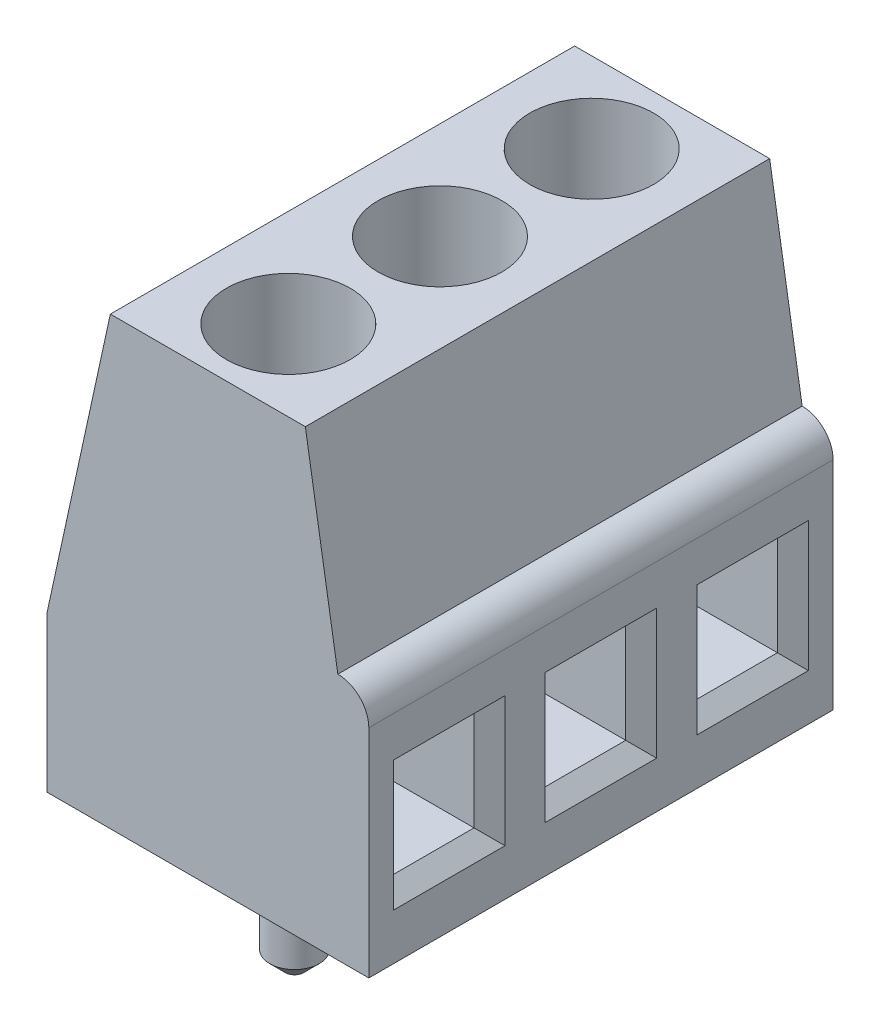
ISO-10303-21;
HEADER;
FILE_DESCRIPTION(('STEP AP214'),'2;1');
FILE_NAME('part.step','',(''),(''),'','','');
FILE_SCHEMA(('AUTOMOTIVE_DESIGN { 1 0 10303 214 1 1 1 1 }'));
ENDSEC;
DATA;
#1=APPLICATION_CONTEXT('core data for automotive mechanical design processes');
#2=APPLICATION_PROTOCOL_DEFINITION('international standard','automotive_design',2000,#1);
#3=PRODUCT_CONTEXT('',#1,'mechanical');
#4=PRODUCT('Part','Part','',(#3));
#5=PRODUCT_RELATED_PRODUCT_CATEGORY('part','',(#4));
#6=PRODUCT_DEFINITION_FORMATION('','',#4);
#7=PRODUCT_DEFINITION_CONTEXT('part definition',#1,'design');
#8=PRODUCT_DEFINITION('design','',#6,#7);
#9=PRODUCT_DEFINITION_SHAPE('','',#8);
#10=(LENGTH_UNIT() NAMED_UNIT(*) SI_UNIT(.MILLI.,.METRE.));
#11=(NAMED_UNIT(*) PLANE_ANGLE_UNIT() SI_UNIT($,.RADIAN.));
#12=(NAMED_UNIT(*) SI_UNIT($,.STERADIAN.) SOLID_ANGLE_UNIT());
#13=UNCERTAINTY_MEASURE_WITH_UNIT(LENGTH_MEASURE(1.E-05),#10,'distance_accuracy_value','');
#14=(GEOMETRIC_REPRESENTATION_CONTEXT(3) GLOBAL_UNCERTAINTY_ASSIGNED_CONTEXT((#13)) GLOBAL_UNIT_ASSIGNED_CONTEXT((#10,
#11,#12)) REPRESENTATION_CONTEXT('',''));
#15=CARTESIAN_POINT('',(0.,0.,0.));
#16=DIRECTION('',(0.,0.,1.));
#17=DIRECTION('',(1.,0.,0.));
#18=AXIS2_PLACEMENT_3D('',#15,#16,#17);
#19=CARTESIAN_POINT('',(-10.4,-8.68947368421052,15.));
#20=DIRECTION('',(1.,0.,0.));
#21=DIRECTION('',(0.,0.,-1.));
#22=AXIS2_PLACEMENT_3D('',#19,#20,#21);
#23=PLANE('',#22);
#24=DIRECTION('',(0.,-1.,0.));
#25=VECTOR('',#24,1.);
#26=CARTESIAN_POINT('',(-10.4,-8.68947368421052,0.));
#27=LINE('',#26,#25);
#28=CARTESIAN_POINT('',(-10.4,-3.68947368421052,0.));
#29=VERTEX_POINT('',#28);
#30=CARTESIAN_POINT('',(-10.4,-8.68947368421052,0.));
#31=VERTEX_POINT('',#30);
#32=EDGE_CURVE('E285',#29,#31,#27,.T.);
#33=ORIENTED_EDGE('',*,*,#32,.T.);
#34=DIRECTION('',(0.,0.,-1.));
#35=VECTOR('',#34,1.);
#36=CARTESIAN_POINT('',(-10.4,-8.68947368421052,15.));
#37=LINE('',#36,#35);
#38=CARTESIAN_POINT('',(-10.4,-8.68947368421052,15.));
#39=VERTEX_POINT('',#38);
#40=EDGE_CURVE('E339',#39,#31,#37,.T.);
#41=ORIENTED_EDGE('',*,*,#40,.F.);
#42=DIRECTION('',(0.,-1.,0.));
#43=VECTOR('',#42,1.);
#44=CARTESIAN_POINT('',(-10.4,-8.68947368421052,15.));
#45=LINE('',#44,#43);
#46=CARTESIAN_POINT('',(-10.4,-3.68947368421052,15.));
#47=VERTEX_POINT('',#46);
#48=EDGE_CURVE('E292',#47,#39,#45,.T.);
#49=ORIENTED_EDGE('',*,*,#48,.F.);
#50=DIRECTION('',(0.,0.,-1.));
#51=VECTOR('',#50,1.);
#52=CARTESIAN_POINT('',(-10.4,-3.68947368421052,15.));
#53=LINE('',#52,#51);
#54=EDGE_CURVE('E308',#47,#29,#53,.T.);
#55=ORIENTED_EDGE('',*,*,#54,.T.);
#56=EDGE_LOOP('',(#33,#41,#49,#55));
#57=FACE_BOUND('',#56,.T.);
#58=ADVANCED_FACE('F35',(#57),#23,.F.);
#59=CARTESIAN_POINT('',(-10.4,-8.68947368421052,15.));
#60=DIRECTION('',(0.,1.,0.));
#61=DIRECTION('',(0.,0.,1.));
#62=AXIS2_PLACEMENT_3D('',#59,#60,#61);
#63=PLANE('',#62);
#64=CARTESIAN_POINT('',(-5.,-8.68947368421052,2.6));
#65=DIRECTION('',(0.,1.,0.));
#66=DIRECTION('',(0.,0.,1.));
#67=AXIS2_PLACEMENT_3D('',#64,#65,#66);
#68=CIRCLE('',#67,0.800000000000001);
#69=CARTESIAN_POINT('',(-5.,-8.68947368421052,3.4));
#70=VERTEX_POINT('',#69);
#71=EDGE_CURVE('E425',#70,#70,#68,.F.);
#72=ORIENTED_EDGE('',*,*,#71,.F.);
#73=EDGE_LOOP('',(#72));
#74=FACE_BOUND('',#73,.T.);
#75=CARTESIAN_POINT('',(-5.,-8.68947368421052,7.5));
#76=DIRECTION('',(0.,1.,0.));
#77=DIRECTION('',(0.,0.,1.));
#78=AXIS2_PLACEMENT_3D('',#75,#76,#77);
#79=CIRCLE('',#78,0.800000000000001);
#80=CARTESIAN_POINT('',(-5.,-8.68947368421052,8.3));
#81=VERTEX_POINT('',#80);
#82=EDGE_CURVE('E422',#81,#81,#79,.F.);
#83=ORIENTED_EDGE('',*,*,#82,.F.);
#84=EDGE_LOOP('',(#83));
#85=FACE_BOUND('',#84,.T.);
#86=CARTESIAN_POINT('',(-5.,-8.68947368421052,12.4));
#87=DIRECTION('',(0.,1.,0.));
#88=DIRECTION('',(0.,0.,1.));
#89=AXIS2_PLACEMENT_3D('',#86,#87,#88);
#90=CIRCLE('',#89,0.800000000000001);
#91=CARTESIAN_POINT('',(-5.,-8.68947368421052,13.2));
#92=VERTEX_POINT('',#91);
#93=EDGE_CURVE('E392',#92,#92,#90,.F.);
#94=ORIENTED_EDGE('',*,*,#93,.F.);
#95=EDGE_LOOP('',(#94));
#96=FACE_BOUND('',#95,.T.);
#97=DIRECTION('',(1.,0.,0.));
#98=VECTOR('',#97,1.);
#99=CARTESIAN_POINT('',(-10.4,-8.68947368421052,0.));
#100=LINE('',#99,#98);
#101=CARTESIAN_POINT('',(0.,-8.68947368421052,0.));
#102=VERTEX_POINT('',#101);
#103=EDGE_CURVE('E311',#31,#102,#100,.T.);
#104=ORIENTED_EDGE('',*,*,#103,.T.);
#105=DIRECTION('',(0.,0.,-1.));
#106=VECTOR('',#105,1.);
#107=CARTESIAN_POINT('',(0.,-8.68947368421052,15.));
#108=LINE('',#107,#106);
#109=CARTESIAN_POINT('',(0.,-8.68947368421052,15.));
#110=VERTEX_POINT('',#109);
#111=EDGE_CURVE('E336',#110,#102,#108,.T.);
#112=ORIENTED_EDGE('',*,*,#111,.F.);
#113=DIRECTION('',(1.,0.,0.));
#114=VECTOR('',#113,1.);
#115=CARTESIAN_POINT('',(-10.4,-8.68947368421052,15.));
#116=LINE('',#115,#114);
#117=EDGE_CURVE('E295',#39,#110,#116,.T.);
#118=ORIENTED_EDGE('',*,*,#117,.F.);
#119=ORIENTED_EDGE('',*,*,#40,.T.);
#120=EDGE_LOOP('',(#104,#112,#118,#119));
#121=FACE_BOUND('',#120,.T.);
#122=ADVANCED_FACE('F459',(#74,#85,#96,#121),#63,.F.);
#123=CARTESIAN_POINT('',(0.,-8.68947368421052,15.));
#124=DIRECTION('',(-1.,0.,0.));
#125=DIRECTION('',(0.,0.,1.));
#126=AXIS2_PLACEMENT_3D('',#123,#124,#125);
#127=PLANE('',#126);
#128=DIRECTION('',(0.,-1.,0.));
#129=VECTOR('',#128,1.);
#130=CARTESIAN_POINT('',(0.,-8.68947368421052,0.799999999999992));
#131=LINE('',#130,#129);
#132=CARTESIAN_POINT('',(0.,-2.98947368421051,0.799999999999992));
#133=VERTEX_POINT('',#132);
#134=CARTESIAN_POINT('',(0.,-7.18947368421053,0.799999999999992));
#135=VERTEX_POINT('',#134);
#136=EDGE_CURVE('E366',#133,#135,#131,.T.);
#137=ORIENTED_EDGE('',*,*,#136,.T.);
#138=DIRECTION('',(0.,0.,1.));
#139=VECTOR('',#138,1.);
#140=CARTESIAN_POINT('',(0.,-7.18947368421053,15.));
#141=LINE('',#140,#139);
#142=CARTESIAN_POINT('',(0.,-7.18947368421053,4.40000000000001));
#143=VERTEX_POINT('',#142);
#144=EDGE_CURVE('E368',#135,#143,#141,.T.);
#145=ORIENTED_EDGE('',*,*,#144,.T.);
#146=DIRECTION('',(0.,1.,0.));
#147=VECTOR('',#146,1.);
#148=CARTESIAN_POINT('',(0.,-8.68947368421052,4.40000000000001));
#149=LINE('',#148,#147);
#150=CARTESIAN_POINT('',(0.,-2.98947368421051,4.40000000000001));
#151=VERTEX_POINT('',#150);
#152=EDGE_CURVE('E362',#143,#151,#149,.T.);
#153=ORIENTED_EDGE('',*,*,#152,.T.);
#154=DIRECTION('',(0.,0.,-1.));
#155=VECTOR('',#154,1.);
#156=CARTESIAN_POINT('',(0.,-2.98947368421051,15.));
#157=LINE('',#156,#155);
#158=EDGE_CURVE('E364',#151,#133,#157,.T.);
#159=ORIENTED_EDGE('',*,*,#158,.T.);
#160=EDGE_LOOP('',(#137,#145,#153,#159));
#161=FACE_BOUND('',#160,.T.);
#162=DIRECTION('',(0.,-1.,0.));
#163=VECTOR('',#162,1.);
#164=CARTESIAN_POINT('',(0.,-8.68947368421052,5.69999999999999));
#165=LINE('',#164,#163);
#166=CARTESIAN_POINT('',(0.,-2.98947368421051,5.69999999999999));
#167=VERTEX_POINT('',#166);
#168=CARTESIAN_POINT('',(0.,-7.18947368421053,5.69999999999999));
#169=VERTEX_POINT('',#168);
#170=EDGE_CURVE('E357',#167,#169,#165,.T.);
#171=ORIENTED_EDGE('',*,*,#170,.T.);
#172=DIRECTION('',(0.,0.,1.));
#173=VECTOR('',#172,1.);
#174=CARTESIAN_POINT('',(0.,-7.18947368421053,15.));
#175=LINE('',#174,#173);
#176=CARTESIAN_POINT('',(0.,-7.18947368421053,9.30000000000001));
#177=VERTEX_POINT('',#176);
#178=EDGE_CURVE('E359',#169,#177,#175,.T.);
#179=ORIENTED_EDGE('',*,*,#178,.T.);
#180=DIRECTION('',(0.,1.,0.));
#181=VECTOR('',#180,1.);
#182=CARTESIAN_POINT('',(0.,-8.68947368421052,9.30000000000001));
#183=LINE('',#182,#181);
#184=CARTESIAN_POINT('',(0.,-2.98947368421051,9.30000000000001));
#185=VERTEX_POINT('',#184);
#186=EDGE_CURVE('E353',#177,#185,#183,.T.);
#187=ORIENTED_EDGE('',*,*,#186,.T.);
#188=DIRECTION('',(0.,0.,-1.));
#189=VECTOR('',#188,1.);
#190=CARTESIAN_POINT('',(0.,-2.98947368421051,15.));
#191=LINE('',#190,#189);
#192=EDGE_CURVE('E355',#185,#167,#191,.T.);
#193=ORIENTED_EDGE('',*,*,#192,.T.);
#194=EDGE_LOOP('',(#171,#179,#187,#193));
#195=FACE_BOUND('',#194,.T.);
#196=DIRECTION('',(0.,-1.,0.));
#197=VECTOR('',#196,1.);
#198=CARTESIAN_POINT('',(0.,-8.68947368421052,10.6));
#199=LINE('',#198,#197);
#200=CARTESIAN_POINT('',(0.,-2.98947368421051,10.6));
#201=VERTEX_POINT('',#200);
#202=CARTESIAN_POINT('',(0.,-7.18947368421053,10.6));
#203=VERTEX_POINT('',#202);
#204=EDGE_CURVE('E346',#201,#203,#199,.T.);
#205=ORIENTED_EDGE('',*,*,#204,.T.);
#206=DIRECTION('',(0.,0.,1.));
#207=VECTOR('',#206,1.);
#208=CARTESIAN_POINT('',(0.,-7.18947368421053,15.));
#209=LINE('',#208,#207);
#210=CARTESIAN_POINT('',(0.,-7.18947368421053,14.2));
#211=VERTEX_POINT('',#210);
#212=EDGE_CURVE('E350',#203,#211,#209,.T.);
#213=ORIENTED_EDGE('',*,*,#212,.T.);
#214=DIRECTION('',(0.,1.,0.));
#215=VECTOR('',#214,1.);
#216=CARTESIAN_POINT('',(0.,-8.68947368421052,14.2));
#217=LINE('',#216,#215);
#218=CARTESIAN_POINT('',(0.,-2.98947368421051,14.2));
#219=VERTEX_POINT('',#218);
#220=EDGE_CURVE('E348',#211,#219,#217,.T.);
#221=ORIENTED_EDGE('',*,*,#220,.T.);
#222=DIRECTION('',(0.,0.,-1.));
#223=VECTOR('',#222,1.);
#224=CARTESIAN_POINT('',(0.,-2.98947368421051,15.));
#225=LINE('',#224,#223);
#226=EDGE_CURVE('E344',#219,#201,#225,.T.);
#227=ORIENTED_EDGE('',*,*,#226,.T.);
#228=EDGE_LOOP('',(#205,#213,#221,#227));
#229=FACE_BOUND('',#228,.T.);
#230=DIRECTION('',(0.,1.,0.));
#231=VECTOR('',#230,1.);
#232=CARTESIAN_POINT('',(0.,-8.68947368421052,0.));
#233=LINE('',#232,#231);
#234=CARTESIAN_POINT('',(0.,-1.68947368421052,0.));
#235=VERTEX_POINT('',#234);
#236=EDGE_CURVE('E313',#102,#235,#233,.T.);
#237=ORIENTED_EDGE('',*,*,#236,.T.);
#238=DIRECTION('',(0.,0.,-1.));
#239=VECTOR('',#238,1.);
#240=CARTESIAN_POINT('',(0.,-1.68947368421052,15.));
#241=LINE('',#240,#239);
#242=CARTESIAN_POINT('',(0.,-1.68947368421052,15.));
#243=VERTEX_POINT('',#242);
#244=EDGE_CURVE('E333',#243,#235,#241,.T.);
#245=ORIENTED_EDGE('',*,*,#244,.F.);
#246=DIRECTION('',(0.,1.,0.));
#247=VECTOR('',#246,1.);
#248=CARTESIAN_POINT('',(0.,-8.68947368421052,15.));
#249=LINE('',#248,#247);
#250=EDGE_CURVE('E298',#110,#243,#249,.T.);
#251=ORIENTED_EDGE('',*,*,#250,.F.);
#252=ORIENTED_EDGE('',*,*,#111,.T.);
#253=EDGE_LOOP('',(#237,#245,#251,#252));
#254=FACE_BOUND('',#253,.T.);
#255=ADVANCED_FACE('F465',(#161,#195,#229,#254),#127,.F.);
#256=CARTESIAN_POINT('',(-1.,-1.68947368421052,15.));
#257=DIRECTION('',(0.,0.,-1.));
#258=DIRECTION('',(-1.,0.,0.));
#259=AXIS2_PLACEMENT_3D('',#256,#257,#258);
#260=CYLINDRICAL_SURFACE('',#259,1.);
#261=CARTESIAN_POINT('',(-1.,-1.68947368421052,0.));
#262=DIRECTION('',(0.,0.,1.));
#263=DIRECTION('',(-1.,0.,0.));
#264=AXIS2_PLACEMENT_3D('',#261,#262,#263);
#265=CIRCLE('',#264,1.);
#266=CARTESIAN_POINT('',(-1.,-0.689473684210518,0.));
#267=VERTEX_POINT('',#266);
#268=EDGE_CURVE('E315',#235,#267,#265,.T.);
#269=ORIENTED_EDGE('',*,*,#268,.T.);
#270=DIRECTION('',(0.,0.,-1.));
#271=VECTOR('',#270,1.);
#272=CARTESIAN_POINT('',(-1.,-0.689473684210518,15.));
#273=LINE('',#272,#271);
#274=CARTESIAN_POINT('',(-1.,-0.689473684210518,15.));
#275=VERTEX_POINT('',#274);
#276=EDGE_CURVE('E330',#275,#267,#273,.T.);
#277=ORIENTED_EDGE('',*,*,#276,.F.);
#278=CARTESIAN_POINT('',(-1.,-1.68947368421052,15.));
#279=DIRECTION('',(0.,0.,1.));
#280=DIRECTION('',(-1.,0.,0.));
#281=AXIS2_PLACEMENT_3D('',#278,#279,#280);
#282=CIRCLE('',#281,1.);
#283=EDGE_CURVE('E300',#243,#275,#282,.T.);
#284=ORIENTED_EDGE('',*,*,#283,.F.);
#285=ORIENTED_EDGE('',*,*,#244,.T.);
#286=EDGE_LOOP('',(#269,#277,#284,#285));
#287=FACE_BOUND('',#286,.T.);
#288=ADVANCED_FACE('F556',(#287),#260,.T.);
#289=CARTESIAN_POINT('',(-2.05,5.71052631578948,15.));
#290=DIRECTION('',(-0.986807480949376,-0.161898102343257,0.));
#291=DIRECTION('',(0.161898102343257,-0.986807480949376,0.));
#292=AXIS2_PLACEMENT_3D('',#289,#290,#291);
#293=PLANE('',#292);
#294=DIRECTION('',(-0.161898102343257,0.986807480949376,0.));
#295=VECTOR('',#294,1.);
#296=CARTESIAN_POINT('',(-2.05,5.71052631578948,0.));
#297=LINE('',#296,#295);
#298=CARTESIAN_POINT('',(-2.05,5.71052631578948,0.));
#299=VERTEX_POINT('',#298);
#300=EDGE_CURVE('E317',#267,#299,#297,.T.);
#301=ORIENTED_EDGE('',*,*,#300,.T.);
#302=DIRECTION('',(0.,0.,-1.));
#303=VECTOR('',#302,1.);
#304=CARTESIAN_POINT('',(-2.05,5.71052631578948,15.));
#305=LINE('',#304,#303);
#306=CARTESIAN_POINT('',(-2.05,5.71052631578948,15.));
#307=VERTEX_POINT('',#306);
#308=EDGE_CURVE('E327',#307,#299,#305,.T.);
#309=ORIENTED_EDGE('',*,*,#308,.F.);
#310=DIRECTION('',(-0.161898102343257,0.986807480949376,0.));
#311=VECTOR('',#310,1.);
#312=CARTESIAN_POINT('',(-2.05,5.71052631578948,15.));
#313=LINE('',#312,#311);
#314=EDGE_CURVE('E302',#275,#307,#313,.T.);
#315=ORIENTED_EDGE('',*,*,#314,.F.);
#316=ORIENTED_EDGE('',*,*,#276,.T.);
#317=EDGE_LOOP('',(#301,#309,#315,#316));
#318=FACE_BOUND('',#317,.T.);
#319=ADVANCED_FACE('F560',(#318),#293,.F.);
#320=CARTESIAN_POINT('',(-8.35,5.71052631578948,15.));
#321=DIRECTION('',(0.,-1.,0.));
#322=DIRECTION('',(0.,0.,-1.));
#323=AXIS2_PLACEMENT_3D('',#320,#321,#322);
#324=PLANE('',#323);
#325=CARTESIAN_POINT('',(-5.2,5.71052631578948,2.6));
#326=DIRECTION('',(0.,1.,0.));
#327=DIRECTION('',(0.,0.,1.));
#328=AXIS2_PLACEMENT_3D('',#325,#326,#327);
#329=CIRCLE('',#328,2.);
#330=CARTESIAN_POINT('',(-5.2,5.71052631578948,4.6));
#331=VERTEX_POINT('',#330);
#332=EDGE_CURVE('E1114',#331,#331,#329,.T.);
#333=ORIENTED_EDGE('',*,*,#332,.F.);
#334=EDGE_LOOP('',(#333));
#335=FACE_BOUND('',#334,.T.);
#336=CARTESIAN_POINT('',(-5.2,5.71052631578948,7.5));
#337=DIRECTION('',(0.,1.,0.));
#338=DIRECTION('',(0.,0.,1.));
#339=AXIS2_PLACEMENT_3D('',#336,#337,#338);
#340=CIRCLE('',#339,2.);
#341=CARTESIAN_POINT('',(-5.2,5.71052631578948,9.5));
#342=VERTEX_POINT('',#341);
#343=EDGE_CURVE('E1113',#342,#342,#340,.T.);
#344=ORIENTED_EDGE('',*,*,#343,.F.);
#345=EDGE_LOOP('',(#344));
#346=FACE_BOUND('',#345,.T.);
#347=CARTESIAN_POINT('',(-5.2,5.71052631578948,12.4));
#348=DIRECTION('',(0.,1.,0.));
#349=DIRECTION('',(0.,0.,1.));
#350=AXIS2_PLACEMENT_3D('',#347,#348,#349);
#351=CIRCLE('',#350,2.);
#352=CARTESIAN_POINT('',(-5.2,5.71052631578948,14.4));
#353=VERTEX_POINT('',#352);
#354=EDGE_CURVE('E235',#353,#353,#351,.T.);
#355=ORIENTED_EDGE('',*,*,#354,.F.);
#356=EDGE_LOOP('',(#355));
#357=FACE_BOUND('',#356,.T.);
#358=DIRECTION('',(-1.,0.,0.));
#359=VECTOR('',#358,1.);
#360=CARTESIAN_POINT('',(-8.35,5.71052631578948,0.));
#361=LINE('',#360,#359);
#362=CARTESIAN_POINT('',(-8.35,5.71052631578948,0.));
#363=VERTEX_POINT('',#362);
#364=EDGE_CURVE('E319',#299,#363,#361,.T.);
#365=ORIENTED_EDGE('',*,*,#364,.T.);
#366=DIRECTION('',(0.,0.,-1.));
#367=VECTOR('',#366,1.);
#368=CARTESIAN_POINT('',(-8.35,5.71052631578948,15.));
#369=LINE('',#368,#367);
#370=CARTESIAN_POINT('',(-8.35,5.71052631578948,15.));
#371=VERTEX_POINT('',#370);
#372=EDGE_CURVE('E324',#371,#363,#369,.T.);
#373=ORIENTED_EDGE('',*,*,#372,.F.);
#374=DIRECTION('',(-1.,0.,0.));
#375=VECTOR('',#374,1.);
#376=CARTESIAN_POINT('',(-8.35,5.71052631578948,15.));
#377=LINE('',#376,#375);
#378=EDGE_CURVE('E304',#307,#371,#377,.T.);
#379=ORIENTED_EDGE('',*,*,#378,.F.);
#380=ORIENTED_EDGE('',*,*,#308,.T.);
#381=EDGE_LOOP('',(#365,#373,#379,#380));
#382=FACE_BOUND('',#381,.T.);
#383=ADVANCED_FACE('F573',(#335,#346,#357,#382),#324,.F.);
#384=CARTESIAN_POINT('',(-10.4,-3.68947368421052,15.));
#385=DIRECTION('',(0.977035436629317,-0.213076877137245,0.));
#386=DIRECTION('',(0.213076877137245,0.977035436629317,0.));
#387=AXIS2_PLACEMENT_3D('',#384,#385,#386);
#388=PLANE('',#387);
#389=DIRECTION('',(-0.213076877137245,-0.977035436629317,0.));
#390=VECTOR('',#389,1.);
#391=CARTESIAN_POINT('',(-10.4,-3.68947368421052,0.));
#392=LINE('',#391,#390);
#393=EDGE_CURVE('E296',#363,#29,#392,.T.);
#394=ORIENTED_EDGE('',*,*,#393,.T.);
#395=ORIENTED_EDGE('',*,*,#54,.F.);
#396=DIRECTION('',(-0.213076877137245,-0.977035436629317,0.));
#397=VECTOR('',#396,1.);
#398=CARTESIAN_POINT('',(-10.4,-3.68947368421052,15.));
#399=LINE('',#398,#397);
#400=EDGE_CURVE('E306',#371,#47,#399,.T.);
#401=ORIENTED_EDGE('',*,*,#400,.F.);
#402=ORIENTED_EDGE('',*,*,#372,.T.);
#403=EDGE_LOOP('',(#394,#395,#401,#402));
#404=FACE_BOUND('',#403,.T.);
#405=ADVANCED_FACE('F571',(#404),#388,.F.);
#406=CARTESIAN_POINT('',(-1.,-1.68947368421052,15.));
#407=DIRECTION('',(0.,0.,-1.));
#408=DIRECTION('',(-1.,0.,0.));
#409=AXIS2_PLACEMENT_3D('',#406,#407,#408);
#410=PLANE('',#409);
#411=ORIENTED_EDGE('',*,*,#48,.T.);
#412=ORIENTED_EDGE('',*,*,#117,.T.);
#413=ORIENTED_EDGE('',*,*,#250,.T.);
#414=ORIENTED_EDGE('',*,*,#283,.T.);
#415=ORIENTED_EDGE('',*,*,#314,.T.);
#416=ORIENTED_EDGE('',*,*,#378,.T.);
#417=ORIENTED_EDGE('',*,*,#400,.T.);
#418=EDGE_LOOP('',(#411,#412,#413,#414,#415,#416,#417));
#419=FACE_BOUND('',#418,.T.);
#420=ADVANCED_FACE('F564',(#419),#410,.F.);
#421=CARTESIAN_POINT('',(-1.,-1.68947368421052,0.));
#422=DIRECTION('',(0.,0.,-1.));
#423=DIRECTION('',(-1.,0.,0.));
#424=AXIS2_PLACEMENT_3D('',#421,#422,#423);
#425=PLANE('',#424);
#426=ORIENTED_EDGE('',*,*,#32,.F.);
#427=ORIENTED_EDGE('',*,*,#393,.F.);
#428=ORIENTED_EDGE('',*,*,#364,.F.);
#429=ORIENTED_EDGE('',*,*,#300,.F.);
#430=ORIENTED_EDGE('',*,*,#268,.F.);
#431=ORIENTED_EDGE('',*,*,#236,.F.);
#432=ORIENTED_EDGE('',*,*,#103,.F.);
#433=EDGE_LOOP('',(#426,#427,#428,#429,#430,#431,#432));
#434=FACE_BOUND('',#433,.T.);
#435=ADVANCED_FACE('F551',(#434),#425,.T.);
#436=CARTESIAN_POINT('',(-5.,-3.48947368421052,13.7));
#437=DIRECTION('',(0.,0.,1.));
#438=DIRECTION('',(1.,0.,0.));
#439=AXIS2_PLACEMENT_3D('',#436,#437,#438);
#440=PLANE('',#439);
#441=DIRECTION('',(1.,0.,0.));
#442=VECTOR('',#441,1.);
#443=CARTESIAN_POINT('',(-5.,-3.48947368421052,13.7));
#444=LINE('',#443,#442);
#445=CARTESIAN_POINT('',(-5.,-3.48947368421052,13.7));
#446=VERTEX_POINT('',#445);
#447=CARTESIAN_POINT('',(-0.500000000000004,-3.48947368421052,13.7));
#448=VERTEX_POINT('',#447);
#449=EDGE_CURVE('E283',#446,#448,#444,.T.);
#450=ORIENTED_EDGE('',*,*,#449,.T.);
#451=DIRECTION('',(0.,-1.,0.));
#452=VECTOR('',#451,1.);
#453=CARTESIAN_POINT('',(-0.500000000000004,-3.48947368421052,13.7));
#454=LINE('',#453,#452);
#455=CARTESIAN_POINT('',(-0.500000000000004,-6.68947368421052,13.7));
#456=VERTEX_POINT('',#455);
#457=EDGE_CURVE('E388',#448,#456,#454,.T.);
#458=ORIENTED_EDGE('',*,*,#457,.T.);
#459=DIRECTION('',(1.,0.,0.));
#460=VECTOR('',#459,1.);
#461=CARTESIAN_POINT('',(-5.,-6.68947368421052,13.7));
#462=LINE('',#461,#460);
#463=CARTESIAN_POINT('',(-5.,-6.68947368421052,13.7));
#464=VERTEX_POINT('',#463);
#465=EDGE_CURVE('E282',#464,#456,#462,.T.);
#466=ORIENTED_EDGE('',*,*,#465,.F.);
#467=DIRECTION('',(0.,-1.,0.));
#468=VECTOR('',#467,1.);
#469=CARTESIAN_POINT('',(-5.,-3.48947368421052,13.7));
#470=LINE('',#469,#468);
#471=EDGE_CURVE('E262',#446,#464,#470,.T.);
#472=ORIENTED_EDGE('',*,*,#471,.F.);
#473=EDGE_LOOP('',(#450,#458,#466,#472));
#474=FACE_BOUND('',#473,.T.);
#475=ADVANCED_FACE('F616',(#474),#440,.F.);
#476=CARTESIAN_POINT('',(-5.,-3.48947368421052,13.7));
#477=DIRECTION('',(0.,1.,0.));
#478=DIRECTION('',(0.,0.,1.));
#479=AXIS2_PLACEMENT_3D('',#476,#477,#478);
#480=PLANE('',#479);
#481=DIRECTION('',(1.,0.,0.));
#482=VECTOR('',#481,1.);
#483=CARTESIAN_POINT('',(-5.,-3.48947368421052,11.1));
#484=LINE('',#483,#482);
#485=CARTESIAN_POINT('',(-5.,-3.48947368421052,11.1));
#486=VERTEX_POINT('',#485);
#487=CARTESIAN_POINT('',(-0.500000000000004,-3.48947368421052,11.1));
#488=VERTEX_POINT('',#487);
#489=EDGE_CURVE('E286',#486,#488,#484,.T.);
#490=ORIENTED_EDGE('',*,*,#489,.T.);
#491=DIRECTION('',(0.,0.,1.));
#492=VECTOR('',#491,1.);
#493=CARTESIAN_POINT('',(-0.500000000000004,-3.48947368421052,13.7));
#494=LINE('',#493,#492);
#495=EDGE_CURVE('E57',#488,#448,#494,.T.);
#496=ORIENTED_EDGE('',*,*,#495,.T.);
#497=ORIENTED_EDGE('',*,*,#449,.F.);
#498=DIRECTION('',(0.,0.,1.));
#499=VECTOR('',#498,1.);
#500=CARTESIAN_POINT('',(-5.,-3.48947368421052,13.7));
#501=LINE('',#500,#499);
#502=EDGE_CURVE('E279',#486,#446,#501,.T.);
#503=ORIENTED_EDGE('',*,*,#502,.F.);
#504=EDGE_LOOP('',(#490,#496,#497,#503));
#505=FACE_BOUND('',#504,.T.);
#506=ADVANCED_FACE('F619',(#505),#480,.F.);
#507=CARTESIAN_POINT('',(-5.,-3.48947368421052,11.1));
#508=DIRECTION('',(0.,0.,-1.));
#509=DIRECTION('',(-1.,0.,0.));
#510=AXIS2_PLACEMENT_3D('',#507,#508,#509);
#511=PLANE('',#510);
#512=DIRECTION('',(1.,0.,0.));
#513=VECTOR('',#512,1.);
#514=CARTESIAN_POINT('',(-5.,-6.68947368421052,11.1));
#515=LINE('',#514,#513);
#516=CARTESIAN_POINT('',(-5.,-6.68947368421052,11.1));
#517=VERTEX_POINT('',#516);
#518=CARTESIAN_POINT('',(-0.500000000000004,-6.68947368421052,11.1));
#519=VERTEX_POINT('',#518);
#520=EDGE_CURVE('E288',#517,#519,#515,.T.);
#521=ORIENTED_EDGE('',*,*,#520,.T.);
#522=DIRECTION('',(0.,1.,0.));
#523=VECTOR('',#522,1.);
#524=CARTESIAN_POINT('',(-0.500000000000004,-3.48947368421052,11.1));
#525=LINE('',#524,#523);
#526=EDGE_CURVE('E50',#519,#488,#525,.T.);
#527=ORIENTED_EDGE('',*,*,#526,.T.);
#528=ORIENTED_EDGE('',*,*,#489,.F.);
#529=DIRECTION('',(0.,1.,0.));
#530=VECTOR('',#529,1.);
#531=CARTESIAN_POINT('',(-5.,-3.48947368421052,11.1));
#532=LINE('',#531,#530);
#533=EDGE_CURVE('E276',#517,#486,#532,.T.);
#534=ORIENTED_EDGE('',*,*,#533,.F.);
#535=EDGE_LOOP('',(#521,#527,#528,#534));
#536=FACE_BOUND('',#535,.T.);
#537=ADVANCED_FACE('F610',(#536),#511,.F.);
#538=CARTESIAN_POINT('',(-5.,-6.68947368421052,13.7));
#539=DIRECTION('',(0.,-1.,0.));
#540=DIRECTION('',(0.,0.,-1.));
#541=AXIS2_PLACEMENT_3D('',#538,#539,#540);
#542=PLANE('',#541);
#543=ORIENTED_EDGE('',*,*,#465,.T.);
#544=DIRECTION('',(0.,0.,-1.));
#545=VECTOR('',#544,1.);
#546=CARTESIAN_POINT('',(-0.500000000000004,-6.68947368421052,13.7));
#547=LINE('',#546,#545);
#548=EDGE_CURVE('E385',#456,#519,#547,.T.);
#549=ORIENTED_EDGE('',*,*,#548,.T.);
#550=ORIENTED_EDGE('',*,*,#520,.F.);
#551=DIRECTION('',(0.,0.,-1.));
#552=VECTOR('',#551,1.);
#553=CARTESIAN_POINT('',(-5.,-6.68947368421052,13.7));
#554=LINE('',#553,#552);
#555=EDGE_CURVE('E273',#464,#517,#554,.T.);
#556=ORIENTED_EDGE('',*,*,#555,.F.);
#557=EDGE_LOOP('',(#543,#549,#550,#556));
#558=FACE_BOUND('',#557,.T.);
#559=ADVANCED_FACE('F607',(#558),#542,.F.);
#560=CARTESIAN_POINT('',(-5.,0.,0.));
#561=DIRECTION('',(1.,0.,0.));
#562=DIRECTION('',(0.,0.,-1.));
#563=AXIS2_PLACEMENT_3D('',#560,#561,#562);
#564=PLANE('',#563);
#565=ORIENTED_EDGE('',*,*,#471,.T.);
#566=ORIENTED_EDGE('',*,*,#555,.T.);
#567=ORIENTED_EDGE('',*,*,#533,.T.);
#568=ORIENTED_EDGE('',*,*,#502,.T.);
#569=EDGE_LOOP('',(#565,#566,#567,#568));
#570=FACE_BOUND('',#569,.T.);
#571=ADVANCED_FACE('F613',(#570),#564,.T.);
#572=CARTESIAN_POINT('',(-5.,-3.48947368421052,8.8));
#573=DIRECTION('',(0.,0.,1.));
#574=DIRECTION('',(0.,-1.,0.));
#575=AXIS2_PLACEMENT_3D('',#572,#573,#574);
#576=PLANE('',#575);
#577=DIRECTION('',(1.,0.,0.));
#578=VECTOR('',#577,1.);
#579=CARTESIAN_POINT('',(-5.,-3.48947368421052,8.8));
#580=LINE('',#579,#578);
#581=CARTESIAN_POINT('',(-5.,-3.48947368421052,8.8));
#582=VERTEX_POINT('',#581);
#583=CARTESIAN_POINT('',(-0.500000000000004,-3.48947368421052,8.8));
#584=VERTEX_POINT('',#583);
#585=EDGE_CURVE('E259',#582,#584,#580,.T.);
#586=ORIENTED_EDGE('',*,*,#585,.T.);
#587=DIRECTION('',(0.,-1.,0.));
#588=VECTOR('',#587,1.);
#589=CARTESIAN_POINT('',(-0.500000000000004,-3.48947368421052,8.8));
#590=LINE('',#589,#588);
#591=CARTESIAN_POINT('',(-0.500000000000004,-6.68947368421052,8.8));
#592=VERTEX_POINT('',#591);
#593=EDGE_CURVE('E383',#584,#592,#590,.T.);
#594=ORIENTED_EDGE('',*,*,#593,.T.);
#595=DIRECTION('',(1.,0.,0.));
#596=VECTOR('',#595,1.);
#597=CARTESIAN_POINT('',(-5.,-6.68947368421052,8.8));
#598=LINE('',#597,#596);
#599=CARTESIAN_POINT('',(-5.,-6.68947368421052,8.8));
#600=VERTEX_POINT('',#599);
#601=EDGE_CURVE('E258',#600,#592,#598,.T.);
#602=ORIENTED_EDGE('',*,*,#601,.F.);
#603=DIRECTION('',(0.,-1.,0.));
#604=VECTOR('',#603,1.);
#605=CARTESIAN_POINT('',(-5.,-3.48947368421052,8.8));
#606=LINE('',#605,#604);
#607=EDGE_CURVE('E242',#582,#600,#606,.T.);
#608=ORIENTED_EDGE('',*,*,#607,.F.);
#609=EDGE_LOOP('',(#586,#594,#602,#608));
#610=FACE_BOUND('',#609,.T.);
#611=ADVANCED_FACE('F662',(#610),#576,.F.);
#612=CARTESIAN_POINT('',(-5.,-3.48947368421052,8.8));
#613=DIRECTION('',(0.,1.,0.));
#614=DIRECTION('',(0.,0.,1.));
#615=AXIS2_PLACEMENT_3D('',#612,#613,#614);
#616=PLANE('',#615);
#617=DIRECTION('',(1.,0.,0.));
#618=VECTOR('',#617,1.);
#619=CARTESIAN_POINT('',(-5.,-3.48947368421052,6.2));
#620=LINE('',#619,#618);
#621=CARTESIAN_POINT('',(-5.,-3.48947368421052,6.2));
#622=VERTEX_POINT('',#621);
#623=CARTESIAN_POINT('',(-0.500000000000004,-3.48947368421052,6.2));
#624=VERTEX_POINT('',#623);
#625=EDGE_CURVE('E263',#622,#624,#620,.T.);
#626=ORIENTED_EDGE('',*,*,#625,.T.);
#627=DIRECTION('',(0.,0.,1.));
#628=VECTOR('',#627,1.);
#629=CARTESIAN_POINT('',(-0.500000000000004,-3.48947368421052,8.8));
#630=LINE('',#629,#628);
#631=EDGE_CURVE('E381',#624,#584,#630,.T.);
#632=ORIENTED_EDGE('',*,*,#631,.T.);
#633=ORIENTED_EDGE('',*,*,#585,.F.);
#634=DIRECTION('',(0.,0.,1.));
#635=VECTOR('',#634,1.);
#636=CARTESIAN_POINT('',(-5.,-3.48947368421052,8.8));
#637=LINE('',#636,#635);
#638=EDGE_CURVE('E255',#622,#582,#637,.T.);
#639=ORIENTED_EDGE('',*,*,#638,.F.);
#640=EDGE_LOOP('',(#626,#632,#633,#639));
#641=FACE_BOUND('',#640,.T.);
#642=ADVANCED_FACE('F656',(#641),#616,.F.);
#643=CARTESIAN_POINT('',(-5.,-3.48947368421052,6.2));
#644=DIRECTION('',(0.,0.,-1.));
#645=DIRECTION('',(0.,1.,0.));
#646=AXIS2_PLACEMENT_3D('',#643,#644,#645);
#647=PLANE('',#646);
#648=DIRECTION('',(1.,0.,0.));
#649=VECTOR('',#648,1.);
#650=CARTESIAN_POINT('',(-5.,-6.68947368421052,6.2));
#651=LINE('',#650,#649);
#652=CARTESIAN_POINT('',(-5.,-6.68947368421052,6.2));
#653=VERTEX_POINT('',#652);
#654=CARTESIAN_POINT('',(-0.500000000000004,-6.68947368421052,6.2));
#655=VERTEX_POINT('',#654);
#656=EDGE_CURVE('E266',#653,#655,#651,.T.);
#657=ORIENTED_EDGE('',*,*,#656,.T.);
#658=DIRECTION('',(0.,1.,0.));
#659=VECTOR('',#658,1.);
#660=CARTESIAN_POINT('',(-0.500000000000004,-3.48947368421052,6.2));
#661=LINE('',#660,#659);
#662=EDGE_CURVE('E379',#655,#624,#661,.T.);
#663=ORIENTED_EDGE('',*,*,#662,.T.);
#664=ORIENTED_EDGE('',*,*,#625,.F.);
#665=DIRECTION('',(0.,1.,0.));
#666=VECTOR('',#665,1.);
#667=CARTESIAN_POINT('',(-5.,-3.48947368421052,6.2));
#668=LINE('',#667,#666);
#669=EDGE_CURVE('E252',#653,#622,#668,.T.);
#670=ORIENTED_EDGE('',*,*,#669,.F.);
#671=EDGE_LOOP('',(#657,#663,#664,#670));
#672=FACE_BOUND('',#671,.T.);
#673=ADVANCED_FACE('F661',(#672),#647,.F.);
#674=CARTESIAN_POINT('',(-5.,-6.68947368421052,8.8));
#675=DIRECTION('',(0.,-1.,0.));
#676=DIRECTION('',(0.,0.,-1.));
#677=AXIS2_PLACEMENT_3D('',#674,#675,#676);
#678=PLANE('',#677);
#679=ORIENTED_EDGE('',*,*,#601,.T.);
#680=DIRECTION('',(0.,0.,-1.));
#681=VECTOR('',#680,1.);
#682=CARTESIAN_POINT('',(-0.500000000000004,-6.68947368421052,8.8));
#683=LINE('',#682,#681);
#684=EDGE_CURVE('E376',#592,#655,#683,.T.);
#685=ORIENTED_EDGE('',*,*,#684,.T.);
#686=ORIENTED_EDGE('',*,*,#656,.F.);
#687=DIRECTION('',(0.,0.,-1.));
#688=VECTOR('',#687,1.);
#689=CARTESIAN_POINT('',(-5.,-6.68947368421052,8.8));
#690=LINE('',#689,#688);
#691=EDGE_CURVE('E249',#600,#653,#690,.T.);
#692=ORIENTED_EDGE('',*,*,#691,.F.);
#693=EDGE_LOOP('',(#679,#685,#686,#692));
#694=FACE_BOUND('',#693,.T.);
#695=ADVANCED_FACE('F674',(#694),#678,.F.);
#696=CARTESIAN_POINT('',(-5.,0.,0.));
#697=DIRECTION('',(1.,0.,0.));
#698=DIRECTION('',(0.,0.,-1.));
#699=AXIS2_PLACEMENT_3D('',#696,#697,#698);
#700=PLANE('',#699);
#701=ORIENTED_EDGE('',*,*,#607,.T.);
#702=ORIENTED_EDGE('',*,*,#691,.T.);
#703=ORIENTED_EDGE('',*,*,#669,.T.);
#704=ORIENTED_EDGE('',*,*,#638,.T.);
#705=EDGE_LOOP('',(#701,#702,#703,#704));
#706=FACE_BOUND('',#705,.T.);
#707=ADVANCED_FACE('F684',(#706),#700,.T.);
#708=CARTESIAN_POINT('',(-5.,-3.48947368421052,3.9));
#709=DIRECTION('',(0.,0.,1.));
#710=DIRECTION('',(0.,-1.,0.));
#711=AXIS2_PLACEMENT_3D('',#708,#709,#710);
#712=PLANE('',#711);
#713=DIRECTION('',(1.,0.,0.));
#714=VECTOR('',#713,1.);
#715=CARTESIAN_POINT('',(-5.,-3.48947368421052,3.9));
#716=LINE('',#715,#714);
#717=CARTESIAN_POINT('',(-5.,-3.48947368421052,3.9));
#718=VERTEX_POINT('',#717);
#719=CARTESIAN_POINT('',(-0.500000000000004,-3.48947368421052,3.9));
#720=VERTEX_POINT('',#719);
#721=EDGE_CURVE('E240',#718,#720,#716,.T.);
#722=ORIENTED_EDGE('',*,*,#721,.T.);
#723=DIRECTION('',(0.,-1.,0.));
#724=VECTOR('',#723,1.);
#725=CARTESIAN_POINT('',(-0.500000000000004,-3.48947368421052,3.9));
#726=LINE('',#725,#724);
#727=CARTESIAN_POINT('',(-0.500000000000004,-6.68947368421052,3.9));
#728=VERTEX_POINT('',#727);
#729=EDGE_CURVE('E211',#720,#728,#726,.T.);
#730=ORIENTED_EDGE('',*,*,#729,.T.);
#731=DIRECTION('',(1.,0.,0.));
#732=VECTOR('',#731,1.);
#733=CARTESIAN_POINT('',(-5.,-6.68947368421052,3.9));
#734=LINE('',#733,#732);
#735=CARTESIAN_POINT('',(-5.,-6.68947368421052,3.9));
#736=VERTEX_POINT('',#735);
#737=EDGE_CURVE('E203',#736,#728,#734,.T.);
#738=ORIENTED_EDGE('',*,*,#737,.F.);
#739=DIRECTION('',(0.,-1.,0.));
#740=VECTOR('',#739,1.);
#741=CARTESIAN_POINT('',(-5.,-3.48947368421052,3.9));
#742=LINE('',#741,#740);
#743=EDGE_CURVE('E208',#718,#736,#742,.T.);
#744=ORIENTED_EDGE('',*,*,#743,.F.);
#745=EDGE_LOOP('',(#722,#730,#738,#744));
#746=FACE_BOUND('',#745,.T.);
#747=ADVANCED_FACE('F206',(#746),#712,.F.);
#748=CARTESIAN_POINT('',(-5.,-3.48947368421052,3.9));
#749=DIRECTION('',(0.,1.,0.));
#750=DIRECTION('',(0.,0.,1.));
#751=AXIS2_PLACEMENT_3D('',#748,#749,#750);
#752=PLANE('',#751);
#753=DIRECTION('',(1.,0.,0.));
#754=VECTOR('',#753,1.);
#755=CARTESIAN_POINT('',(-5.,-3.48947368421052,1.3));
#756=LINE('',#755,#754);
#757=CARTESIAN_POINT('',(-5.,-3.48947368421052,1.3));
#758=VERTEX_POINT('',#757);
#759=CARTESIAN_POINT('',(-0.500000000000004,-3.48947368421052,1.3));
#760=VERTEX_POINT('',#759);
#761=EDGE_CURVE('E243',#758,#760,#756,.T.);
#762=ORIENTED_EDGE('',*,*,#761,.T.);
#763=DIRECTION('',(0.,0.,1.));
#764=VECTOR('',#763,1.);
#765=CARTESIAN_POINT('',(-0.500000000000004,-3.48947368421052,3.9));
#766=LINE('',#765,#764);
#767=EDGE_CURVE('E373',#760,#720,#766,.T.);
#768=ORIENTED_EDGE('',*,*,#767,.T.);
#769=ORIENTED_EDGE('',*,*,#721,.F.);
#770=DIRECTION('',(0.,0.,1.));
#771=VECTOR('',#770,1.);
#772=CARTESIAN_POINT('',(-5.,-3.48947368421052,3.9));
#773=LINE('',#772,#771);
#774=EDGE_CURVE('E216',#758,#718,#773,.T.);
#775=ORIENTED_EDGE('',*,*,#774,.F.);
#776=EDGE_LOOP('',(#762,#768,#769,#775));
#777=FACE_BOUND('',#776,.T.);
#778=ADVANCED_FACE('F699',(#777),#752,.F.);
#779=CARTESIAN_POINT('',(-5.,-3.48947368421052,1.3));
#780=DIRECTION('',(0.,0.,-1.));
#781=DIRECTION('',(0.,1.,0.));
#782=AXIS2_PLACEMENT_3D('',#779,#780,#781);
#783=PLANE('',#782);
#784=DIRECTION('',(1.,0.,0.));
#785=VECTOR('',#784,1.);
#786=CARTESIAN_POINT('',(-5.,-6.68947368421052,1.3));
#787=LINE('',#786,#785);
#788=CARTESIAN_POINT('',(-5.,-6.68947368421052,1.3));
#789=VERTEX_POINT('',#788);
#790=CARTESIAN_POINT('',(-0.500000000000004,-6.68947368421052,1.3));
#791=VERTEX_POINT('',#790);
#792=EDGE_CURVE('E215',#789,#791,#787,.T.);
#793=ORIENTED_EDGE('',*,*,#792,.T.);
#794=DIRECTION('',(0.,1.,0.));
#795=VECTOR('',#794,1.);
#796=CARTESIAN_POINT('',(-0.500000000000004,-3.48947368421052,1.3));
#797=LINE('',#796,#795);
#798=EDGE_CURVE('E371',#791,#760,#797,.T.);
#799=ORIENTED_EDGE('',*,*,#798,.T.);
#800=ORIENTED_EDGE('',*,*,#761,.F.);
#801=DIRECTION('',(0.,1.,0.));
#802=VECTOR('',#801,1.);
#803=CARTESIAN_POINT('',(-5.,-3.48947368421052,1.3));
#804=LINE('',#803,#802);
#805=EDGE_CURVE('E225',#789,#758,#804,.T.);
#806=ORIENTED_EDGE('',*,*,#805,.F.);
#807=EDGE_LOOP('',(#793,#799,#800,#806));
#808=FACE_BOUND('',#807,.T.);
#809=ADVANCED_FACE('F704',(#808),#783,.F.);
#810=CARTESIAN_POINT('',(-5.,-6.68947368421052,3.9));
#811=DIRECTION('',(0.,-1.,0.));
#812=DIRECTION('',(0.,0.,-1.));
#813=AXIS2_PLACEMENT_3D('',#810,#811,#812);
#814=PLANE('',#813);
#815=ORIENTED_EDGE('',*,*,#737,.T.);
#816=DIRECTION('',(0.,0.,-1.));
#817=VECTOR('',#816,1.);
#818=CARTESIAN_POINT('',(-0.500000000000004,-6.68947368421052,3.9));
#819=LINE('',#818,#817);
#820=EDGE_CURVE('E342',#728,#791,#819,.T.);
#821=ORIENTED_EDGE('',*,*,#820,.T.);
#822=ORIENTED_EDGE('',*,*,#792,.F.);
#823=DIRECTION('',(0.,0.,-1.));
#824=VECTOR('',#823,1.);
#825=CARTESIAN_POINT('',(-5.,-6.68947368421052,3.9));
#826=LINE('',#825,#824);
#827=EDGE_CURVE('E219',#736,#789,#826,.T.);
#828=ORIENTED_EDGE('',*,*,#827,.F.);
#829=EDGE_LOOP('',(#815,#821,#822,#828));
#830=FACE_BOUND('',#829,.T.);
#831=ADVANCED_FACE('F220',(#830),#814,.F.);
#832=CARTESIAN_POINT('',(-5.,0.,0.));
#833=DIRECTION('',(1.,0.,0.));
#834=DIRECTION('',(0.,0.,-1.));
#835=AXIS2_PLACEMENT_3D('',#832,#833,#834);
#836=PLANE('',#835);
#837=ORIENTED_EDGE('',*,*,#743,.T.);
#838=ORIENTED_EDGE('',*,*,#827,.T.);
#839=ORIENTED_EDGE('',*,*,#805,.T.);
#840=ORIENTED_EDGE('',*,*,#774,.T.);
#841=EDGE_LOOP('',(#837,#838,#839,#840));
#842=FACE_BOUND('',#841,.T.);
#843=ADVANCED_FACE('F227',(#842),#836,.T.);
#844=CARTESIAN_POINT('',(-0.500000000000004,-3.48947368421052,3.9));
#845=DIRECTION('',(-0.70710678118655,0.707106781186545,0.));
#846=DIRECTION('',(0.,0.,1.));
#847=AXIS2_PLACEMENT_3D('',#844,#845,#846);
#848=PLANE('',#847);
#849=DIRECTION('',(0.577350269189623,0.577350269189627,-0.577350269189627));
#850=VECTOR('',#849,1.);
#851=CARTESIAN_POINT('',(-0.500000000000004,-3.48947368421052,1.3));
#852=LINE('',#851,#850);
#853=EDGE_CURVE('E232',#133,#760,#852,.F.);
#854=ORIENTED_EDGE('',*,*,#853,.F.);
#855=ORIENTED_EDGE('',*,*,#158,.F.);
#856=DIRECTION('',(0.577350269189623,0.577350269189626,0.577350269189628));
#857=VECTOR('',#856,1.);
#858=CARTESIAN_POINT('',(-0.500000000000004,-3.48947368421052,3.9));
#859=LINE('',#858,#857);
#860=EDGE_CURVE('E229',#720,#151,#859,.T.);
#861=ORIENTED_EDGE('',*,*,#860,.F.);
#862=ORIENTED_EDGE('',*,*,#767,.F.);
#863=EDGE_LOOP('',(#854,#855,#861,#862));
#864=FACE_BOUND('',#863,.T.);
#865=ADVANCED_FACE('F482',(#864),#848,.F.);
#866=CARTESIAN_POINT('',(-0.500000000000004,-3.48947368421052,3.9));
#867=DIRECTION('',(-0.707106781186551,0.,0.707106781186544));
#868=DIRECTION('',(0.,-1.,0.));
#869=AXIS2_PLACEMENT_3D('',#866,#867,#868);
#870=PLANE('',#869);
#871=ORIENTED_EDGE('',*,*,#860,.T.);
#872=ORIENTED_EDGE('',*,*,#152,.F.);
#873=DIRECTION('',(-0.577350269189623,0.577350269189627,-0.577350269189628));
#874=VECTOR('',#873,1.);
#875=CARTESIAN_POINT('',(-0.500000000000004,-6.68947368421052,3.9));
#876=LINE('',#875,#874);
#877=EDGE_CURVE('E395',#728,#143,#876,.F.);
#878=ORIENTED_EDGE('',*,*,#877,.F.);
#879=ORIENTED_EDGE('',*,*,#729,.F.);
#880=EDGE_LOOP('',(#871,#872,#878,#879));
#881=FACE_BOUND('',#880,.T.);
#882=ADVANCED_FACE('F478',(#881),#870,.F.);
#883=CARTESIAN_POINT('',(-0.500000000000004,-3.48947368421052,1.3));
#884=DIRECTION('',(-0.70710678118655,0.,-0.707106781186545));
#885=DIRECTION('',(0.,1.,0.));
#886=AXIS2_PLACEMENT_3D('',#883,#884,#885);
#887=PLANE('',#886);
#888=ORIENTED_EDGE('',*,*,#853,.T.);
#889=ORIENTED_EDGE('',*,*,#798,.F.);
#890=DIRECTION('',(0.577350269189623,-0.577350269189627,-0.577350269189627));
#891=VECTOR('',#890,1.);
#892=CARTESIAN_POINT('',(-1.36666666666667,-5.82280701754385,2.16666666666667));
#893=LINE('',#892,#891);
#894=EDGE_CURVE('E393',#135,#791,#893,.F.);
#895=ORIENTED_EDGE('',*,*,#894,.F.);
#896=ORIENTED_EDGE('',*,*,#136,.F.);
#897=EDGE_LOOP('',(#888,#889,#895,#896));
#898=FACE_BOUND('',#897,.T.);
#899=ADVANCED_FACE('F474',(#898),#887,.F.);
#900=CARTESIAN_POINT('',(-0.500000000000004,-6.68947368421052,3.9));
#901=DIRECTION('',(-0.70710678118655,-0.707106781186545,0.));
#902=DIRECTION('',(0.,0.,-1.));
#903=AXIS2_PLACEMENT_3D('',#900,#901,#902);
#904=PLANE('',#903);
#905=ORIENTED_EDGE('',*,*,#877,.T.);
#906=ORIENTED_EDGE('',*,*,#144,.F.);
#907=ORIENTED_EDGE('',*,*,#894,.T.);
#908=ORIENTED_EDGE('',*,*,#820,.F.);
#909=EDGE_LOOP('',(#905,#906,#907,#908));
#910=FACE_BOUND('',#909,.T.);
#911=ADVANCED_FACE('F470',(#910),#904,.F.);
#912=CARTESIAN_POINT('',(-0.500000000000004,-3.48947368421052,8.8));
#913=DIRECTION('',(-0.70710678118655,0.707106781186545,0.));
#914=DIRECTION('',(0.,0.,1.));
#915=AXIS2_PLACEMENT_3D('',#912,#913,#914);
#916=PLANE('',#915);
#917=DIRECTION('',(0.577350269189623,0.577350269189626,-0.577350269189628));
#918=VECTOR('',#917,1.);
#919=CARTESIAN_POINT('',(-0.500000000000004,-3.48947368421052,6.2));
#920=LINE('',#919,#918);
#921=EDGE_CURVE('E405',#167,#624,#920,.F.);
#922=ORIENTED_EDGE('',*,*,#921,.F.);
#923=ORIENTED_EDGE('',*,*,#192,.F.);
#924=DIRECTION('',(0.577350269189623,0.577350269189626,0.577350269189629));
#925=VECTOR('',#924,1.);
#926=CARTESIAN_POINT('',(-0.500000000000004,-3.48947368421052,8.8));
#927=LINE('',#926,#925);
#928=EDGE_CURVE('E396',#584,#185,#927,.T.);
#929=ORIENTED_EDGE('',*,*,#928,.F.);
#930=ORIENTED_EDGE('',*,*,#631,.F.);
#931=EDGE_LOOP('',(#922,#923,#929,#930));
#932=FACE_BOUND('',#931,.T.);
#933=ADVANCED_FACE('F473',(#932),#916,.F.);
#934=CARTESIAN_POINT('',(-0.500000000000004,-3.48947368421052,8.8));
#935=DIRECTION('',(-0.707106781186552,0.,0.707106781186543));
#936=DIRECTION('',(0.,-1.,0.));
#937=AXIS2_PLACEMENT_3D('',#934,#935,#936);
#938=PLANE('',#937);
#939=ORIENTED_EDGE('',*,*,#928,.T.);
#940=ORIENTED_EDGE('',*,*,#186,.F.);
#941=DIRECTION('',(-0.577350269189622,0.577350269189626,-0.577350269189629));
#942=VECTOR('',#941,1.);
#943=CARTESIAN_POINT('',(-0.500000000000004,-6.68947368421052,8.8));
#944=LINE('',#943,#942);
#945=EDGE_CURVE('E402',#592,#177,#944,.F.);
#946=ORIENTED_EDGE('',*,*,#945,.F.);
#947=ORIENTED_EDGE('',*,*,#593,.F.);
#948=EDGE_LOOP('',(#939,#940,#946,#947));
#949=FACE_BOUND('',#948,.T.);
#950=ADVANCED_FACE('F495',(#949),#938,.F.);
#951=CARTESIAN_POINT('',(-0.500000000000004,-3.48947368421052,6.2));
#952=DIRECTION('',(-0.707106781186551,0.,-0.707106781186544));
#953=DIRECTION('',(0.,1.,0.));
#954=AXIS2_PLACEMENT_3D('',#951,#952,#953);
#955=PLANE('',#954);
#956=ORIENTED_EDGE('',*,*,#921,.T.);
#957=ORIENTED_EDGE('',*,*,#662,.F.);
#958=DIRECTION('',(0.577350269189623,-0.577350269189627,-0.577350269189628));
#959=VECTOR('',#958,1.);
#960=CARTESIAN_POINT('',(-1.36666666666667,-5.82280701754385,7.06666666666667));
#961=LINE('',#960,#959);
#962=EDGE_CURVE('E400',#169,#655,#961,.F.);
#963=ORIENTED_EDGE('',*,*,#962,.F.);
#964=ORIENTED_EDGE('',*,*,#170,.F.);
#965=EDGE_LOOP('',(#956,#957,#963,#964));
#966=FACE_BOUND('',#965,.T.);
#967=ADVANCED_FACE('F491',(#966),#955,.F.);
#968=CARTESIAN_POINT('',(-0.500000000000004,-6.68947368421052,8.8));
#969=DIRECTION('',(-0.70710678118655,-0.707106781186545,0.));
#970=DIRECTION('',(0.,0.,-1.));
#971=AXIS2_PLACEMENT_3D('',#968,#969,#970);
#972=PLANE('',#971);
#973=ORIENTED_EDGE('',*,*,#945,.T.);
#974=ORIENTED_EDGE('',*,*,#178,.F.);
#975=ORIENTED_EDGE('',*,*,#962,.T.);
#976=ORIENTED_EDGE('',*,*,#684,.F.);
#977=EDGE_LOOP('',(#973,#974,#975,#976));
#978=FACE_BOUND('',#977,.T.);
#979=ADVANCED_FACE('F487',(#978),#972,.F.);
#980=CARTESIAN_POINT('',(-0.500000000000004,-3.48947368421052,13.7));
#981=DIRECTION('',(-0.70710678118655,0.707106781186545,0.));
#982=DIRECTION('',(0.,0.,1.));
#983=AXIS2_PLACEMENT_3D('',#980,#981,#982);
#984=PLANE('',#983);
#985=DIRECTION('',(0.577350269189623,0.577350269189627,-0.577350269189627));
#986=VECTOR('',#985,1.);
#987=CARTESIAN_POINT('',(-0.500000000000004,-3.48947368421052,11.1));
#988=LINE('',#987,#986);
#989=EDGE_CURVE('E415',#201,#488,#988,.F.);
#990=ORIENTED_EDGE('',*,*,#989,.F.);
#991=ORIENTED_EDGE('',*,*,#226,.F.);
#992=DIRECTION('',(-0.577350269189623,-0.577350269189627,-0.577350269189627));
#993=VECTOR('',#992,1.);
#994=CARTESIAN_POINT('',(-0.500000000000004,-3.48947368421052,13.7));
#995=LINE('',#994,#993);
#996=EDGE_CURVE('E403',#448,#219,#995,.F.);
#997=ORIENTED_EDGE('',*,*,#996,.F.);
#998=ORIENTED_EDGE('',*,*,#495,.F.);
#999=EDGE_LOOP('',(#990,#991,#997,#998));
#1000=FACE_BOUND('',#999,.T.);
#1001=ADVANCED_FACE('F490',(#1000),#984,.F.);
#1002=CARTESIAN_POINT('',(-0.500000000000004,-3.48947368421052,13.7));
#1003=DIRECTION('',(-0.70710678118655,0.,0.707106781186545));
#1004=DIRECTION('',(0.,-1.,0.));
#1005=AXIS2_PLACEMENT_3D('',#1002,#1003,#1004);
#1006=PLANE('',#1005);
#1007=ORIENTED_EDGE('',*,*,#996,.T.);
#1008=ORIENTED_EDGE('',*,*,#220,.F.);
#1009=DIRECTION('',(-0.577350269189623,0.577350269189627,-0.577350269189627));
#1010=VECTOR('',#1009,1.);
#1011=CARTESIAN_POINT('',(-0.500000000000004,-6.68947368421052,13.7));
#1012=LINE('',#1011,#1010);
#1013=EDGE_CURVE('E412',#456,#211,#1012,.F.);
#1014=ORIENTED_EDGE('',*,*,#1013,.F.);
#1015=ORIENTED_EDGE('',*,*,#457,.F.);
#1016=EDGE_LOOP('',(#1007,#1008,#1014,#1015));
#1017=FACE_BOUND('',#1016,.T.);
#1018=ADVANCED_FACE('F511',(#1017),#1006,.F.);
#1019=CARTESIAN_POINT('',(-0.500000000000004,-3.48947368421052,11.1));
#1020=DIRECTION('',(-0.70710678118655,0.,-0.707106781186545));
#1021=DIRECTION('',(0.,1.,0.));
#1022=AXIS2_PLACEMENT_3D('',#1019,#1020,#1021);
#1023=PLANE('',#1022);
#1024=ORIENTED_EDGE('',*,*,#989,.T.);
#1025=ORIENTED_EDGE('',*,*,#526,.F.);
#1026=DIRECTION('',(0.577350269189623,-0.577350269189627,-0.577350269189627));
#1027=VECTOR('',#1026,1.);
#1028=CARTESIAN_POINT('',(-1.36666666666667,-5.82280701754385,11.9666666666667));
#1029=LINE('',#1028,#1027);
#1030=EDGE_CURVE('E410',#203,#519,#1029,.F.);
#1031=ORIENTED_EDGE('',*,*,#1030,.F.);
#1032=ORIENTED_EDGE('',*,*,#204,.F.);
#1033=EDGE_LOOP('',(#1024,#1025,#1031,#1032));
#1034=FACE_BOUND('',#1033,.T.);
#1035=ADVANCED_FACE('F507',(#1034),#1023,.F.);
#1036=CARTESIAN_POINT('',(-0.500000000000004,-6.68947368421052,13.7));
#1037=DIRECTION('',(-0.70710678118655,-0.707106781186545,0.));
#1038=DIRECTION('',(0.,0.,-1.));
#1039=AXIS2_PLACEMENT_3D('',#1036,#1037,#1038);
#1040=PLANE('',#1039);
#1041=ORIENTED_EDGE('',*,*,#1013,.T.);
#1042=ORIENTED_EDGE('',*,*,#212,.F.);
#1043=ORIENTED_EDGE('',*,*,#1030,.T.);
#1044=ORIENTED_EDGE('',*,*,#548,.F.);
#1045=EDGE_LOOP('',(#1041,#1042,#1043,#1044));
#1046=FACE_BOUND('',#1045,.T.);
#1047=ADVANCED_FACE('F503',(#1046),#1040,.F.);
#1048=CARTESIAN_POINT('',(-5.,-12.1894736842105,12.4));
#1049=DIRECTION('',(0.,1.,0.));
#1050=DIRECTION('',(0.,0.,1.));
#1051=AXIS2_PLACEMENT_3D('',#1048,#1049,#1050);
#1052=CYLINDRICAL_SURFACE('',#1051,0.800000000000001);
#1053=CARTESIAN_POINT('',(-5.,-11.6894736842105,12.4));
#1054=DIRECTION('',(0.,-1.,0.));
#1055=DIRECTION('',(0.,0.,-1.));
#1056=AXIS2_PLACEMENT_3D('',#1053,#1054,#1055);
#1057=CIRCLE('',#1056,0.800000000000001);
#1058=CARTESIAN_POINT('',(-5.,-11.6894736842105,11.6));
#1059=VERTEX_POINT('',#1058);
#1060=EDGE_CURVE('E11',#1059,#1059,#1057,.F.);
#1061=ORIENTED_EDGE('',*,*,#1060,.T.);
#1062=EDGE_LOOP('',(#1061));
#1063=FACE_BOUND('',#1062,.T.);
#1064=ORIENTED_EDGE('',*,*,#93,.T.);
#1065=EDGE_LOOP('',(#1064));
#1066=FACE_BOUND('',#1065,.T.);
#1067=ADVANCED_FACE('F506',(#1063,#1066),#1052,.T.);
#1068=CARTESIAN_POINT('',(-5.,-12.1894736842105,12.4));
#1069=DIRECTION('',(0.,-1.,0.));
#1070=DIRECTION('',(0.,0.,-1.));
#1071=AXIS2_PLACEMENT_3D('',#1068,#1069,#1070);
#1072=PLANE('',#1071);
#1073=CARTESIAN_POINT('',(-5.,-12.1894736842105,12.4));
#1074=DIRECTION('',(0.,-1.,0.));
#1075=DIRECTION('',(0.,0.,-1.));
#1076=AXIS2_PLACEMENT_3D('',#1073,#1074,#1075);
#1077=CIRCLE('',#1076,0.300000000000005);
#1078=CARTESIAN_POINT('',(-5.,-12.1894736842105,12.1));
#1079=VERTEX_POINT('',#1078);
#1080=EDGE_CURVE('E43',#1079,#1079,#1077,.T.);
#1081=ORIENTED_EDGE('',*,*,#1080,.T.);
#1082=EDGE_LOOP('',(#1081));
#1083=FACE_BOUND('',#1082,.T.);
#1084=ADVANCED_FACE('F442',(#1083),#1072,.T.);
#1085=CARTESIAN_POINT('',(-5.,-12.1894736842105,7.5));
#1086=DIRECTION('',(0.,1.,0.));
#1087=DIRECTION('',(0.,0.,1.));
#1088=AXIS2_PLACEMENT_3D('',#1085,#1086,#1087);
#1089=CYLINDRICAL_SURFACE('',#1088,0.800000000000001);
#1090=CARTESIAN_POINT('',(-5.,-11.6894736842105,7.5));
#1091=DIRECTION('',(0.,-1.,0.));
#1092=DIRECTION('',(0.,0.,-1.));
#1093=AXIS2_PLACEMENT_3D('',#1090,#1091,#1092);
#1094=CIRCLE('',#1093,0.800000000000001);
#1095=CARTESIAN_POINT('',(-5.,-11.6894736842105,6.7));
#1096=VERTEX_POINT('',#1095);
#1097=EDGE_CURVE('E437',#1096,#1096,#1094,.F.);
#1098=ORIENTED_EDGE('',*,*,#1097,.T.);
#1099=EDGE_LOOP('',(#1098));
#1100=FACE_BOUND('',#1099,.T.);
#1101=ORIENTED_EDGE('',*,*,#82,.T.);
#1102=EDGE_LOOP('',(#1101));
#1103=FACE_BOUND('',#1102,.T.);
#1104=ADVANCED_FACE('F764',(#1100,#1103),#1089,.T.);
#1105=CARTESIAN_POINT('',(-5.,-12.1894736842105,7.5));
#1106=DIRECTION('',(0.,-1.,0.));
#1107=DIRECTION('',(0.,0.,-1.));
#1108=AXIS2_PLACEMENT_3D('',#1105,#1106,#1107);
#1109=PLANE('',#1108);
#1110=CARTESIAN_POINT('',(-5.,-12.1894736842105,7.5));
#1111=DIRECTION('',(0.,-1.,0.));
#1112=DIRECTION('',(0.,0.,-1.));
#1113=AXIS2_PLACEMENT_3D('',#1110,#1111,#1112);
#1114=CIRCLE('',#1113,0.300000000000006);
#1115=CARTESIAN_POINT('',(-5.,-12.1894736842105,7.19999999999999));
#1116=VERTEX_POINT('',#1115);
#1117=EDGE_CURVE('E434',#1116,#1116,#1114,.T.);
#1118=ORIENTED_EDGE('',*,*,#1117,.T.);
#1119=EDGE_LOOP('',(#1118));
#1120=FACE_BOUND('',#1119,.T.);
#1121=ADVANCED_FACE('F534',(#1120),#1109,.T.);
#1122=CARTESIAN_POINT('',(-5.,-12.1894736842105,2.6));
#1123=DIRECTION('',(0.,1.,0.));
#1124=DIRECTION('',(0.,0.,1.));
#1125=AXIS2_PLACEMENT_3D('',#1122,#1123,#1124);
#1126=CYLINDRICAL_SURFACE('',#1125,0.800000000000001);
#1127=CARTESIAN_POINT('',(-5.,-11.6894736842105,2.6));
#1128=DIRECTION('',(0.,-1.,0.));
#1129=DIRECTION('',(0.,0.,-1.));
#1130=AXIS2_PLACEMENT_3D('',#1127,#1128,#1129);
#1131=CIRCLE('',#1130,0.800000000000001);
#1132=CARTESIAN_POINT('',(-5.,-11.6894736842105,1.8));
#1133=VERTEX_POINT('',#1132);
#1134=EDGE_CURVE('E431',#1133,#1133,#1131,.F.);
#1135=ORIENTED_EDGE('',*,*,#1134,.T.);
#1136=EDGE_LOOP('',(#1135));
#1137=FACE_BOUND('',#1136,.T.);
#1138=ORIENTED_EDGE('',*,*,#71,.T.);
#1139=EDGE_LOOP('',(#1138));
#1140=FACE_BOUND('',#1139,.T.);
#1141=ADVANCED_FACE('F525',(#1137,#1140),#1126,.T.);
#1142=CARTESIAN_POINT('',(-5.,-12.1894736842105,2.6));
#1143=DIRECTION('',(0.,-1.,0.));
#1144=DIRECTION('',(0.,0.,-1.));
#1145=AXIS2_PLACEMENT_3D('',#1142,#1143,#1144);
#1146=PLANE('',#1145);
#1147=CARTESIAN_POINT('',(-5.,-12.1894736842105,2.6));
#1148=DIRECTION('',(0.,-1.,0.));
#1149=DIRECTION('',(0.,0.,-1.));
#1150=AXIS2_PLACEMENT_3D('',#1147,#1148,#1149);
#1151=CIRCLE('',#1150,0.300000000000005);
#1152=CARTESIAN_POINT('',(-5.,-12.1894736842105,2.29999999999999));
#1153=VERTEX_POINT('',#1152);
#1154=EDGE_CURVE('E428',#1153,#1153,#1151,.T.);
#1155=ORIENTED_EDGE('',*,*,#1154,.T.);
#1156=EDGE_LOOP('',(#1155));
#1157=FACE_BOUND('',#1156,.T.);
#1158=ADVANCED_FACE('F520',(#1157),#1146,.T.);
#1159=CARTESIAN_POINT('',(-5.,-12.1894736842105,2.6));
#1160=DIRECTION('',(0.,1.,0.));
#1161=DIRECTION('',(0.,0.,1.));
#1162=AXIS2_PLACEMENT_3D('',#1159,#1160,#1161);
#1163=CONICAL_SURFACE('',#1162,0.300000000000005,0.785398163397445);
#1164=ORIENTED_EDGE('',*,*,#1134,.F.);
#1165=EDGE_LOOP('',(#1164));
#1166=FACE_BOUND('',#1165,.T.);
#1167=ORIENTED_EDGE('',*,*,#1154,.F.);
#1168=EDGE_LOOP('',(#1167));
#1169=FACE_BOUND('',#1168,.T.);
#1170=ADVANCED_FACE('F455',(#1166,#1169),#1163,.T.);
#1171=CARTESIAN_POINT('',(-5.,-12.1894736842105,7.5));
#1172=DIRECTION('',(0.,1.,0.));
#1173=DIRECTION('',(0.,0.,1.));
#1174=AXIS2_PLACEMENT_3D('',#1171,#1172,#1173);
#1175=CONICAL_SURFACE('',#1174,0.300000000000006,0.785398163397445);
#1176=ORIENTED_EDGE('',*,*,#1097,.F.);
#1177=EDGE_LOOP('',(#1176));
#1178=FACE_BOUND('',#1177,.T.);
#1179=ORIENTED_EDGE('',*,*,#1117,.F.);
#1180=EDGE_LOOP('',(#1179));
#1181=FACE_BOUND('',#1180,.T.);
#1182=ADVANCED_FACE('F446',(#1178,#1181),#1175,.T.);
#1183=CARTESIAN_POINT('',(-5.,-12.1894736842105,12.4));
#1184=DIRECTION('',(0.,1.,0.));
#1185=DIRECTION('',(0.,0.,1.));
#1186=AXIS2_PLACEMENT_3D('',#1183,#1184,#1185);
#1187=CONICAL_SURFACE('',#1186,0.300000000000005,0.785398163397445);
#1188=ORIENTED_EDGE('',*,*,#1060,.F.);
#1189=EDGE_LOOP('',(#1188));
#1190=FACE_BOUND('',#1189,.T.);
#1191=ORIENTED_EDGE('',*,*,#1080,.F.);
#1192=EDGE_LOOP('',(#1191));
#1193=FACE_BOUND('',#1192,.T.);
#1194=ADVANCED_FACE('F37',(#1190,#1193),#1187,.T.);
#1195=CARTESIAN_POINT('',(-5.2,2.71052631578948,12.4));
#1196=DIRECTION('',(0.,1.,0.));
#1197=DIRECTION('',(0.,0.,1.));
#1198=AXIS2_PLACEMENT_3D('',#1195,#1196,#1197);
#1199=CYLINDRICAL_SURFACE('',#1198,2.);
#1200=CARTESIAN_POINT('',(-5.2,2.71052631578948,12.4));
#1201=DIRECTION('',(0.,1.,0.));
#1202=DIRECTION('',(0.,0.,1.));
#1203=AXIS2_PLACEMENT_3D('',#1200,#1201,#1202);
#1204=CIRCLE('',#1203,2.);
#1205=CARTESIAN_POINT('',(-5.2,2.71052631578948,14.4));
#1206=VERTEX_POINT('',#1205);
#1207=EDGE_CURVE('E413',#1206,#1206,#1204,.T.);
#1208=ORIENTED_EDGE('',*,*,#1207,.F.);
#1209=EDGE_LOOP('',(#1208));
#1210=FACE_BOUND('',#1209,.T.);
#1211=ORIENTED_EDGE('',*,*,#354,.T.);
#1212=EDGE_LOOP('',(#1211));
#1213=FACE_BOUND('',#1212,.T.);
#1214=ADVANCED_FACE('F445',(#1210,#1213),#1199,.F.);
#1215=CARTESIAN_POINT('',(-5.2,2.71052631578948,12.4));
#1216=DIRECTION('',(0.,1.,0.));
#1217=DIRECTION('',(0.,0.,1.));
#1218=AXIS2_PLACEMENT_3D('',#1215,#1216,#1217);
#1219=PLANE('',#1218);
#1220=ORIENTED_EDGE('',*,*,#1207,.T.);
#1221=EDGE_LOOP('',(#1220));
#1222=FACE_BOUND('',#1221,.T.);
#1223=ADVANCED_FACE('F452',(#1222),#1219,.T.);
#1224=CARTESIAN_POINT('',(-5.2,2.71052631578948,7.5));
#1225=DIRECTION('',(0.,1.,0.));
#1226=DIRECTION('',(0.,0.,1.));
#1227=AXIS2_PLACEMENT_3D('',#1224,#1225,#1226);
#1228=CYLINDRICAL_SURFACE('',#1227,2.);
#1229=CARTESIAN_POINT('',(-5.2,2.71052631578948,7.5));
#1230=DIRECTION('',(0.,1.,0.));
#1231=DIRECTION('',(0.,0.,1.));
#1232=AXIS2_PLACEMENT_3D('',#1229,#1230,#1231);
#1233=CIRCLE('',#1232,2.);
#1234=CARTESIAN_POINT('',(-5.2,2.71052631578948,9.5));
#1235=VERTEX_POINT('',#1234);
#1236=EDGE_CURVE('E1117',#1235,#1235,#1233,.T.);
#1237=ORIENTED_EDGE('',*,*,#1236,.F.);
#1238=EDGE_LOOP('',(#1237));
#1239=FACE_BOUND('',#1238,.T.);
#1240=ORIENTED_EDGE('',*,*,#343,.T.);
#1241=EDGE_LOOP('',(#1240));
#1242=FACE_BOUND('',#1241,.T.);
#1243=ADVANCED_FACE('F810',(#1239,#1242),#1228,.F.);
#1244=CARTESIAN_POINT('',(-5.2,2.71052631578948,7.5));
#1245=DIRECTION('',(0.,1.,0.));
#1246=DIRECTION('',(0.,0.,1.));
#1247=AXIS2_PLACEMENT_3D('',#1244,#1245,#1246);
#1248=PLANE('',#1247);
#1249=ORIENTED_EDGE('',*,*,#1236,.T.);
#1250=EDGE_LOOP('',(#1249));
#1251=FACE_BOUND('',#1250,.T.);
#1252=ADVANCED_FACE('F826',(#1251),#1248,.T.);
#1253=CARTESIAN_POINT('',(-5.2,2.71052631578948,2.6));
#1254=DIRECTION('',(0.,1.,0.));
#1255=DIRECTION('',(0.,0.,1.));
#1256=AXIS2_PLACEMENT_3D('',#1253,#1254,#1255);
#1257=CYLINDRICAL_SURFACE('',#1256,2.);
#1258=CARTESIAN_POINT('',(-5.2,2.71052631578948,2.6));
#1259=DIRECTION('',(0.,1.,0.));
#1260=DIRECTION('',(0.,0.,1.));
#1261=AXIS2_PLACEMENT_3D('',#1258,#1259,#1260);
#1262=CIRCLE('',#1261,2.);
#1263=CARTESIAN_POINT('',(-5.2,2.71052631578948,4.6));
#1264=VERTEX_POINT('',#1263);
#1265=EDGE_CURVE('E1112',#1264,#1264,#1262,.T.);
#1266=ORIENTED_EDGE('',*,*,#1265,.F.);
#1267=EDGE_LOOP('',(#1266));
#1268=FACE_BOUND('',#1267,.T.);
#1269=ORIENTED_EDGE('',*,*,#332,.T.);
#1270=EDGE_LOOP('',(#1269));
#1271=FACE_BOUND('',#1270,.T.);
#1272=ADVANCED_FACE('F836',(#1268,#1271),#1257,.F.);
#1273=CARTESIAN_POINT('',(-5.2,2.71052631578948,2.6));
#1274=DIRECTION('',(0.,1.,0.));
#1275=DIRECTION('',(0.,0.,1.));
#1276=AXIS2_PLACEMENT_3D('',#1273,#1274,#1275);
#1277=PLANE('',#1276);
#1278=ORIENTED_EDGE('',*,*,#1265,.T.);
#1279=EDGE_LOOP('',(#1278));
#1280=FACE_BOUND('',#1279,.T.);
#1281=ADVANCED_FACE('F846',(#1280),#1277,.T.);
#1282=CLOSED_SHELL('',(#58,#122,#255,#288,#319,#383,#405,#420,#435,#475,#506,#537,#559,#571,
#611,#642,#673,#695,#707,#747,#778,#809,#831,#843,#865,#882,#899,#911,#933,#950,#967,#979,#1001,
#1018,#1035,#1047,#1067,#1084,#1104,#1121,#1141,#1158,#1170,#1182,#1194,#1214,#1223,#1243,#1252,
#1272,#1281));
#1283=MANIFOLD_SOLID_BREP('B2',#1282);
#1284=ADVANCED_BREP_SHAPE_REPRESENTATION('',(#18,#1283),#14);
#1285=SHAPE_DEFINITION_REPRESENTATION(#9,#1284);
ENDSEC;
END-ISO-10303-21;
